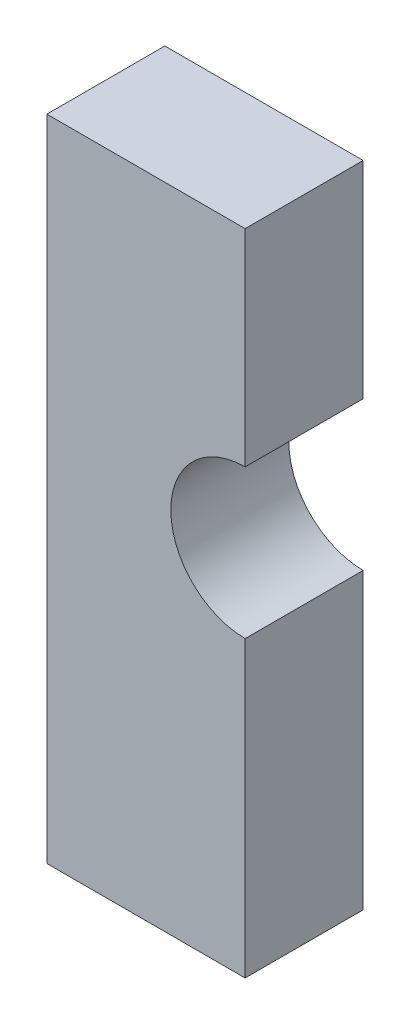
ISO-10303-21;
HEADER;
FILE_DESCRIPTION(('STEP AP214'),'2;1');
FILE_NAME('part.step','',(''),(''),'','','');
FILE_SCHEMA(('AUTOMOTIVE_DESIGN { 1 0 10303 214 1 1 1 1 }'));
ENDSEC;
DATA;
#1=APPLICATION_CONTEXT('core data for automotive mechanical design processes');
#2=APPLICATION_PROTOCOL_DEFINITION('international standard','automotive_design',2000,#1);
#3=PRODUCT_CONTEXT('',#1,'mechanical');
#4=PRODUCT('Part','Part','',(#3));
#5=PRODUCT_RELATED_PRODUCT_CATEGORY('part','',(#4));
#6=PRODUCT_DEFINITION_FORMATION('','',#4);
#7=PRODUCT_DEFINITION_CONTEXT('part definition',#1,'design');
#8=PRODUCT_DEFINITION('design','',#6,#7);
#9=PRODUCT_DEFINITION_SHAPE('','',#8);
#10=(LENGTH_UNIT() NAMED_UNIT(*) SI_UNIT(.MILLI.,.METRE.));
#11=(NAMED_UNIT(*) PLANE_ANGLE_UNIT() SI_UNIT($,.RADIAN.));
#12=(NAMED_UNIT(*) SI_UNIT($,.STERADIAN.) SOLID_ANGLE_UNIT());
#13=UNCERTAINTY_MEASURE_WITH_UNIT(LENGTH_MEASURE(1.E-05),#10,'distance_accuracy_value','');
#14=(GEOMETRIC_REPRESENTATION_CONTEXT(3) GLOBAL_UNCERTAINTY_ASSIGNED_CONTEXT((#13)) GLOBAL_UNIT_ASSIGNED_CONTEXT((#10,
#11,#12)) REPRESENTATION_CONTEXT('',''));
#15=CARTESIAN_POINT('',(0.,0.,0.));
#16=DIRECTION('',(0.,0.,1.));
#17=DIRECTION('',(1.,0.,0.));
#18=AXIS2_PLACEMENT_3D('',#15,#16,#17);
#19=CARTESIAN_POINT('',(21.3396382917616,69.8500000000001,-12.7));
#20=DIRECTION('',(1.,0.,0.));
#21=DIRECTION('',(0.,0.,-1.));
#22=AXIS2_PLACEMENT_3D('',#19,#20,#21);
#23=PLANE('',#22);
#24=DIRECTION('',(0.,1.,0.));
#25=VECTOR('',#24,1.);
#26=CARTESIAN_POINT('',(21.3396382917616,69.8500000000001,0.));
#27=LINE('',#26,#25);
#28=CARTESIAN_POINT('',(21.3396382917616,47.638980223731,0.));
#29=VERTEX_POINT('',#28);
#30=CARTESIAN_POINT('',(21.3396382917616,69.8500000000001,0.));
#31=VERTEX_POINT('',#30);
#32=EDGE_CURVE('E120',#29,#31,#27,.T.);
#33=ORIENTED_EDGE('',*,*,#32,.F.);
#34=DIRECTION('',(0.,0.,1.));
#35=VECTOR('',#34,1.);
#36=CARTESIAN_POINT('',(21.3396382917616,47.638980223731,-12.7));
#37=LINE('',#36,#35);
#38=CARTESIAN_POINT('',(21.3396382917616,47.638980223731,-12.7));
#39=VERTEX_POINT('',#38);
#40=EDGE_CURVE('E11',#39,#29,#37,.T.);
#41=ORIENTED_EDGE('',*,*,#40,.F.);
#42=DIRECTION('',(0.,1.,0.));
#43=VECTOR('',#42,1.);
#44=CARTESIAN_POINT('',(21.3396382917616,69.8500000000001,-12.7));
#45=LINE('',#44,#43);
#46=CARTESIAN_POINT('',(21.3396382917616,69.8500000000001,-12.7));
#47=VERTEX_POINT('',#46);
#48=EDGE_CURVE('E134',#39,#47,#45,.T.);
#49=ORIENTED_EDGE('',*,*,#48,.T.);
#50=DIRECTION('',(0.,0.,1.));
#51=VECTOR('',#50,1.);
#52=CARTESIAN_POINT('',(21.3396382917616,69.8500000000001,-12.7));
#53=LINE('',#52,#51);
#54=EDGE_CURVE('E38',#47,#31,#53,.T.);
#55=ORIENTED_EDGE('',*,*,#54,.T.);
#56=EDGE_LOOP('',(#33,#41,#49,#55));
#57=FACE_BOUND('',#56,.T.);
#58=ADVANCED_FACE('F35',(#57),#23,.T.);
#59=CARTESIAN_POINT('',(21.3396382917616,39.638980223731,-12.7));
#60=DIRECTION('',(0.,0.,1.));
#61=DIRECTION('',(1.,0.,0.));
#62=AXIS2_PLACEMENT_3D('',#59,#60,#61);
#63=CYLINDRICAL_SURFACE('',#62,8.);
#64=CARTESIAN_POINT('',(21.3396382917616,39.638980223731,0.));
#65=DIRECTION('',(0.,0.,-1.));
#66=DIRECTION('',(1.,0.,0.));
#67=AXIS2_PLACEMENT_3D('',#64,#65,#66);
#68=CIRCLE('',#67,8.);
#69=CARTESIAN_POINT('',(21.3396382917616,31.638980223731,0.));
#70=VERTEX_POINT('',#69);
#71=EDGE_CURVE('E132',#70,#29,#68,.T.);
#72=ORIENTED_EDGE('',*,*,#71,.F.);
#73=DIRECTION('',(0.,0.,1.));
#74=VECTOR('',#73,1.);
#75=CARTESIAN_POINT('',(21.3396382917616,31.638980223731,-12.7));
#76=LINE('',#75,#74);
#77=CARTESIAN_POINT('',(21.3396382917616,31.638980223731,-12.7));
#78=VERTEX_POINT('',#77);
#79=EDGE_CURVE('E44',#78,#70,#76,.T.);
#80=ORIENTED_EDGE('',*,*,#79,.F.);
#81=CARTESIAN_POINT('',(21.3396382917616,39.638980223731,-12.7));
#82=DIRECTION('',(0.,0.,-1.));
#83=DIRECTION('',(1.,0.,0.));
#84=AXIS2_PLACEMENT_3D('',#81,#82,#83);
#85=CIRCLE('',#84,8.);
#86=EDGE_CURVE('E110',#78,#39,#85,.T.);
#87=ORIENTED_EDGE('',*,*,#86,.T.);
#88=ORIENTED_EDGE('',*,*,#40,.T.);
#89=EDGE_LOOP('',(#72,#80,#87,#88));
#90=FACE_BOUND('',#89,.T.);
#91=ADVANCED_FACE('F142',(#90),#63,.F.);
#92=CARTESIAN_POINT('',(21.3396382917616,31.638980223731,-12.7));
#93=DIRECTION('',(1.,0.,0.));
#94=DIRECTION('',(0.,1.,0.));
#95=AXIS2_PLACEMENT_3D('',#92,#93,#94);
#96=PLANE('',#95);
#97=DIRECTION('',(0.,1.,0.));
#98=VECTOR('',#97,1.);
#99=CARTESIAN_POINT('',(21.3396382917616,31.638980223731,0.));
#100=LINE('',#99,#98);
#101=CARTESIAN_POINT('',(21.3396382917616,0.,0.));
#102=VERTEX_POINT('',#101);
#103=EDGE_CURVE('E97',#102,#70,#100,.T.);
#104=ORIENTED_EDGE('',*,*,#103,.F.);
#105=DIRECTION('',(0.,0.,1.));
#106=VECTOR('',#105,1.);
#107=CARTESIAN_POINT('',(21.3396382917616,0.,-12.7));
#108=LINE('',#107,#106);
#109=CARTESIAN_POINT('',(21.3396382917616,0.,-12.7));
#110=VERTEX_POINT('',#109);
#111=EDGE_CURVE('E92',#110,#102,#108,.T.);
#112=ORIENTED_EDGE('',*,*,#111,.F.);
#113=DIRECTION('',(0.,1.,0.));
#114=VECTOR('',#113,1.);
#115=CARTESIAN_POINT('',(21.3396382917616,31.638980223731,-12.7));
#116=LINE('',#115,#114);
#117=EDGE_CURVE('E95',#110,#78,#116,.T.);
#118=ORIENTED_EDGE('',*,*,#117,.T.);
#119=ORIENTED_EDGE('',*,*,#79,.T.);
#120=EDGE_LOOP('',(#104,#112,#118,#119));
#121=FACE_BOUND('',#120,.T.);
#122=ADVANCED_FACE('F94',(#121),#96,.T.);
#123=CARTESIAN_POINT('',(21.3396382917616,0.,-12.7));
#124=DIRECTION('',(0.,-1.,0.));
#125=DIRECTION('',(1.,0.,0.));
#126=AXIS2_PLACEMENT_3D('',#123,#124,#125);
#127=PLANE('',#126);
#128=DIRECTION('',(1.,0.,0.));
#129=VECTOR('',#128,1.);
#130=CARTESIAN_POINT('',(21.3396382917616,0.,0.));
#131=LINE('',#130,#129);
#132=CARTESIAN_POINT('',(0.,0.,0.));
#133=VERTEX_POINT('',#132);
#134=EDGE_CURVE('E129',#133,#102,#131,.T.);
#135=ORIENTED_EDGE('',*,*,#134,.F.);
#136=DIRECTION('',(0.,0.,1.));
#137=VECTOR('',#136,1.);
#138=CARTESIAN_POINT('',(0.,0.,-12.7));
#139=LINE('',#138,#137);
#140=CARTESIAN_POINT('',(0.,0.,-12.7));
#141=VERTEX_POINT('',#140);
#142=EDGE_CURVE('E102',#141,#133,#139,.T.);
#143=ORIENTED_EDGE('',*,*,#142,.F.);
#144=DIRECTION('',(1.,0.,0.));
#145=VECTOR('',#144,1.);
#146=CARTESIAN_POINT('',(21.3396382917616,0.,-12.7));
#147=LINE('',#146,#145);
#148=EDGE_CURVE('E108',#141,#110,#147,.T.);
#149=ORIENTED_EDGE('',*,*,#148,.T.);
#150=ORIENTED_EDGE('',*,*,#111,.T.);
#151=EDGE_LOOP('',(#135,#143,#149,#150));
#152=FACE_BOUND('',#151,.T.);
#153=ADVANCED_FACE('F112',(#152),#127,.T.);
#154=CARTESIAN_POINT('',(0.,69.8500000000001,-12.7));
#155=DIRECTION('',(-1.,0.,0.));
#156=DIRECTION('',(0.,-1.,0.));
#157=AXIS2_PLACEMENT_3D('',#154,#155,#156);
#158=PLANE('',#157);
#159=DIRECTION('',(0.,-1.,0.));
#160=VECTOR('',#159,1.);
#161=CARTESIAN_POINT('',(0.,69.8500000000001,0.));
#162=LINE('',#161,#160);
#163=CARTESIAN_POINT('',(0.,69.8500000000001,0.));
#164=VERTEX_POINT('',#163);
#165=EDGE_CURVE('E126',#164,#133,#162,.T.);
#166=ORIENTED_EDGE('',*,*,#165,.F.);
#167=DIRECTION('',(0.,0.,1.));
#168=VECTOR('',#167,1.);
#169=CARTESIAN_POINT('',(0.,69.8500000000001,-12.7));
#170=LINE('',#169,#168);
#171=CARTESIAN_POINT('',(0.,69.8500000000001,-12.7));
#172=VERTEX_POINT('',#171);
#173=EDGE_CURVE('E137',#172,#164,#170,.T.);
#174=ORIENTED_EDGE('',*,*,#173,.F.);
#175=DIRECTION('',(0.,-1.,0.));
#176=VECTOR('',#175,1.);
#177=CARTESIAN_POINT('',(0.,69.8500000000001,-12.7));
#178=LINE('',#177,#176);
#179=EDGE_CURVE('E113',#172,#141,#178,.T.);
#180=ORIENTED_EDGE('',*,*,#179,.T.);
#181=ORIENTED_EDGE('',*,*,#142,.T.);
#182=EDGE_LOOP('',(#166,#174,#180,#181));
#183=FACE_BOUND('',#182,.T.);
#184=ADVANCED_FACE('F155',(#183),#158,.T.);
#185=CARTESIAN_POINT('',(21.3396382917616,69.8500000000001,-12.7));
#186=DIRECTION('',(0.,1.,0.));
#187=DIRECTION('',(0.,0.,1.));
#188=AXIS2_PLACEMENT_3D('',#185,#186,#187);
#189=PLANE('',#188);
#190=DIRECTION('',(-1.,0.,0.));
#191=VECTOR('',#190,1.);
#192=CARTESIAN_POINT('',(21.3396382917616,69.8500000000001,0.));
#193=LINE('',#192,#191);
#194=EDGE_CURVE('E123',#31,#164,#193,.T.);
#195=ORIENTED_EDGE('',*,*,#194,.F.);
#196=ORIENTED_EDGE('',*,*,#54,.F.);
#197=DIRECTION('',(-1.,0.,0.));
#198=VECTOR('',#197,1.);
#199=CARTESIAN_POINT('',(21.3396382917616,69.8500000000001,-12.7));
#200=LINE('',#199,#198);
#201=EDGE_CURVE('E115',#47,#172,#200,.T.);
#202=ORIENTED_EDGE('',*,*,#201,.T.);
#203=ORIENTED_EDGE('',*,*,#173,.T.);
#204=EDGE_LOOP('',(#195,#196,#202,#203));
#205=FACE_BOUND('',#204,.T.);
#206=ADVANCED_FACE('F139',(#205),#189,.T.);
#207=CARTESIAN_POINT('',(21.3396382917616,39.638980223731,-12.7));
#208=DIRECTION('',(0.,0.,1.));
#209=DIRECTION('',(1.,0.,0.));
#210=AXIS2_PLACEMENT_3D('',#207,#208,#209);
#211=PLANE('',#210);
#212=ORIENTED_EDGE('',*,*,#48,.F.);
#213=ORIENTED_EDGE('',*,*,#86,.F.);
#214=ORIENTED_EDGE('',*,*,#117,.F.);
#215=ORIENTED_EDGE('',*,*,#148,.F.);
#216=ORIENTED_EDGE('',*,*,#179,.F.);
#217=ORIENTED_EDGE('',*,*,#201,.F.);
#218=EDGE_LOOP('',(#212,#213,#214,#215,#216,#217));
#219=FACE_BOUND('',#218,.T.);
#220=ADVANCED_FACE('F106',(#219),#211,.F.);
#221=CARTESIAN_POINT('',(21.3396382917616,39.638980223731,0.));
#222=DIRECTION('',(0.,0.,1.));
#223=DIRECTION('',(1.,0.,0.));
#224=AXIS2_PLACEMENT_3D('',#221,#222,#223);
#225=PLANE('',#224);
#226=ORIENTED_EDGE('',*,*,#32,.T.);
#227=ORIENTED_EDGE('',*,*,#194,.T.);
#228=ORIENTED_EDGE('',*,*,#165,.T.);
#229=ORIENTED_EDGE('',*,*,#134,.T.);
#230=ORIENTED_EDGE('',*,*,#103,.T.);
#231=ORIENTED_EDGE('',*,*,#71,.T.);
#232=EDGE_LOOP('',(#226,#227,#228,#229,#230,#231));
#233=FACE_BOUND('',#232,.T.);
#234=ADVANCED_FACE('F141',(#233),#225,.T.);
#235=CLOSED_SHELL('',(#58,#91,#122,#153,#184,#206,#220,#234));
#236=MANIFOLD_SOLID_BREP('B2',#235);
#237=ADVANCED_BREP_SHAPE_REPRESENTATION('',(#18,#236),#14);
#238=SHAPE_DEFINITION_REPRESENTATION(#9,#237);
ENDSEC;
END-ISO-10303-21;
